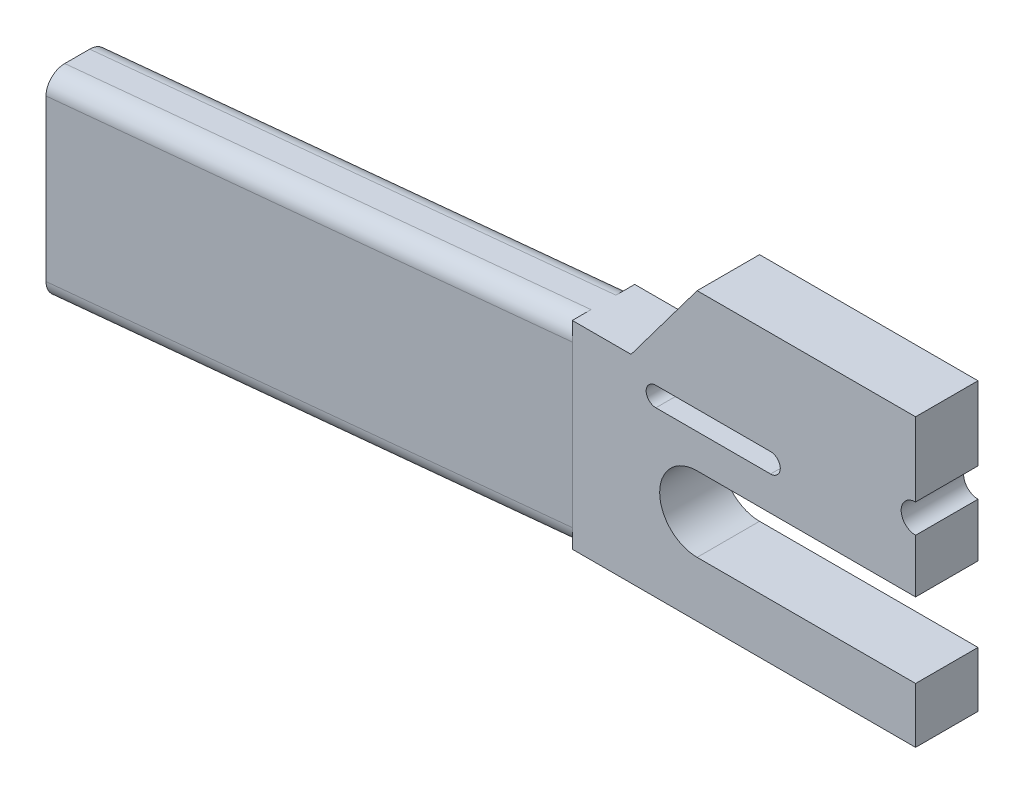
ISO-10303-21;
HEADER;
FILE_DESCRIPTION(('STEP AP214'),'2;1');
FILE_NAME('part.step','',(''),(''),'','','');
FILE_SCHEMA(('AUTOMOTIVE_DESIGN { 1 0 10303 214 1 1 1 1 }'));
ENDSEC;
DATA;
#1=APPLICATION_CONTEXT('core data for automotive mechanical design processes');
#2=APPLICATION_PROTOCOL_DEFINITION('international standard','automotive_design',2000,#1);
#3=PRODUCT_CONTEXT('',#1,'mechanical');
#4=PRODUCT('Part','Part','',(#3));
#5=PRODUCT_RELATED_PRODUCT_CATEGORY('part','',(#4));
#6=PRODUCT_DEFINITION_FORMATION('','',#4);
#7=PRODUCT_DEFINITION_CONTEXT('part definition',#1,'design');
#8=PRODUCT_DEFINITION('design','',#6,#7);
#9=PRODUCT_DEFINITION_SHAPE('','',#8);
#10=(LENGTH_UNIT() NAMED_UNIT(*) SI_UNIT(.MILLI.,.METRE.));
#11=(NAMED_UNIT(*) PLANE_ANGLE_UNIT() SI_UNIT($,.RADIAN.));
#12=(NAMED_UNIT(*) SI_UNIT($,.STERADIAN.) SOLID_ANGLE_UNIT());
#13=UNCERTAINTY_MEASURE_WITH_UNIT(LENGTH_MEASURE(1.E-05),#10,'distance_accuracy_value','');
#14=(GEOMETRIC_REPRESENTATION_CONTEXT(3) GLOBAL_UNCERTAINTY_ASSIGNED_CONTEXT((#13)) GLOBAL_UNIT_ASSIGNED_CONTEXT((#10,
#11,#12)) REPRESENTATION_CONTEXT('',''));
#15=CARTESIAN_POINT('',(0.,0.,0.));
#16=DIRECTION('',(0.,0.,1.));
#17=DIRECTION('',(1.,0.,0.));
#18=AXIS2_PLACEMENT_3D('',#15,#16,#17);
#19=CARTESIAN_POINT('',(-42.9289137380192,18.7333231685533,10.));
#20=DIRECTION('',(1.,0.,0.));
#21=DIRECTION('',(0.,1.,0.));
#22=AXIS2_PLACEMENT_3D('',#19,#20,#21);
#23=PLANE('',#22);
#24=DIRECTION('',(0.,0.,-1.));
#25=VECTOR('',#24,1.);
#26=CARTESIAN_POINT('',(-42.9289137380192,18.7333231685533,10.));
#27=LINE('',#26,#25);
#28=CARTESIAN_POINT('',(-42.9289137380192,18.7333231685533,10.));
#29=VERTEX_POINT('',#28);
#30=CARTESIAN_POINT('',(-42.9289137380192,18.7333231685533,6.99999999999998));
#31=VERTEX_POINT('',#30);
#32=EDGE_CURVE('E666',#29,#31,#27,.T.);
#33=ORIENTED_EDGE('',*,*,#32,.T.);
#34=CARTESIAN_POINT('',(-42.9289137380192,15.7333231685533,10.));
#35=CARTESIAN_POINT('',(-42.9289137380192,15.8177030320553,10.0000080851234));
#36=CARTESIAN_POINT('',(-42.9289137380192,15.9020790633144,9.99644004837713));
#37=CARTESIAN_POINT('',(-42.9289137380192,16.0702274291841,9.98221429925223));
#38=CARTESIAN_POINT('',(-42.9289137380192,16.1539997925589,9.97155692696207));
#39=CARTESIAN_POINT('',(-42.9289137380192,16.3202901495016,9.94322577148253));
#40=CARTESIAN_POINT('',(-42.9289137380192,16.4028090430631,9.92555729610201));
#41=CARTESIAN_POINT('',(-42.9289137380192,16.5660449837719,9.88334725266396));
#42=CARTESIAN_POINT('',(-42.9289137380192,16.6467620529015,9.85880576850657));
#43=CARTESIAN_POINT('',(-42.9289137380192,16.8854317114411,9.77507005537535));
#44=CARTESIAN_POINT('',(-42.9289137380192,17.0399704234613,9.70575297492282));
#45=CARTESIAN_POINT('',(-42.9289137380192,17.3351033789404,9.54220373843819));
#46=CARTESIAN_POINT('',(-42.9289137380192,17.4757000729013,9.44797597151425));
#47=CARTESIAN_POINT('',(-42.9289137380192,17.7391018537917,9.23724864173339));
#48=CARTESIAN_POINT('',(-42.9289137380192,17.8619071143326,9.12074929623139));
#49=CARTESIAN_POINT('',(-42.9289137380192,18.0862344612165,8.86876200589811));
#50=CARTESIAN_POINT('',(-42.9289137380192,18.1877523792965,8.73327035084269));
#51=CARTESIAN_POINT('',(-42.9289137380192,18.3666153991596,8.44715266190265));
#52=CARTESIAN_POINT('',(-42.9289137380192,18.4439557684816,8.29652367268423));
#53=CARTESIAN_POINT('',(-42.9289137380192,18.5722097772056,7.98444905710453));
#54=CARTESIAN_POINT('',(-42.9289137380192,18.623138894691,7.82300982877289));
#55=CARTESIAN_POINT('',(-42.9289137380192,18.6844685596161,7.55048555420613));
#56=CARTESIAN_POINT('',(-42.9289137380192,18.7027779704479,7.44111489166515));
#57=CARTESIAN_POINT('',(-42.9289137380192,18.7272036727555,7.22117810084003));
#58=CARTESIAN_POINT('',(-42.9289137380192,18.7333372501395,7.11061389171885));
#59=CARTESIAN_POINT('',(-42.9289137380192,18.7333231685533,7.00000000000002));
#60=B_SPLINE_CURVE_WITH_KNOTS('',3,(#34,#35,#36,#37,#38,#39,#40,#41,#42,#43,#44,#45,#46,#47,#48,
#49,#50,#51,#52,#53,#54,#55,#56,#57,#58,#59),.UNSPECIFIED.,.F.,.F.,(4,2,2,2,2,2,2,2,2,2,2,2,4),
(0.,0.253057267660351,0.506102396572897,0.758956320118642,1.01180715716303,1.51730545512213,
2.02271474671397,2.528119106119,3.03362233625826,3.5392244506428,4.04452992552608,
4.37657668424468,4.70815170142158),.UNSPECIFIED.);
#61=CARTESIAN_POINT('',(-42.9289137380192,15.7333231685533,10.));
#62=VERTEX_POINT('',#61);
#63=EDGE_CURVE('E542',#62,#31,#60,.T.);
#64=ORIENTED_EDGE('',*,*,#63,.F.);
#65=DIRECTION('',(0.,-1.,0.));
#66=VECTOR('',#65,1.);
#67=CARTESIAN_POINT('',(-42.9289137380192,18.7333231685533,10.));
#68=LINE('',#67,#66);
#69=EDGE_CURVE('E643',#29,#62,#68,.T.);
#70=ORIENTED_EDGE('',*,*,#69,.F.);
#71=EDGE_LOOP('',(#33,#64,#70));
#72=FACE_BOUND('',#71,.T.);
#73=ADVANCED_FACE('F355',(#72),#23,.F.);
#74=CARTESIAN_POINT('',(-42.9289137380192,-10.0131929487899,10.));
#75=VERTEX_POINT('',#74);
#76=CARTESIAN_POINT('',(-42.9289137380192,-13.0131929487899,10.));
#77=VERTEX_POINT('',#76);
#78=EDGE_CURVE('E642',#75,#77,#68,.T.);
#79=ORIENTED_EDGE('',*,*,#78,.F.);
#80=CARTESIAN_POINT('',(-42.9289137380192,-13.0131929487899,6.99999999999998));
#81=CARTESIAN_POINT('',(-42.9289137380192,-13.0132010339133,7.08437986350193));
#82=CARTESIAN_POINT('',(-42.9289137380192,-13.009632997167,7.16875589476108));
#83=CARTESIAN_POINT('',(-42.9289137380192,-12.9954072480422,7.33690426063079));
#84=CARTESIAN_POINT('',(-42.9289137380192,-12.9847498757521,7.42067662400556));
#85=CARTESIAN_POINT('',(-42.9289137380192,-12.9564187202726,7.58696698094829));
#86=CARTESIAN_POINT('',(-42.9289137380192,-12.938750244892,7.66948587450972));
#87=CARTESIAN_POINT('',(-42.9289137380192,-12.8965402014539,7.83272181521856));
#88=CARTESIAN_POINT('',(-42.9289137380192,-12.8719987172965,7.9134388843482));
#89=CARTESIAN_POINT('',(-42.9289137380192,-12.7882630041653,8.1521085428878));
#90=CARTESIAN_POINT('',(-42.9289137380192,-12.7189459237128,8.30664725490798));
#91=CARTESIAN_POINT('',(-42.9289137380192,-12.5553966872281,8.60178021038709));
#92=CARTESIAN_POINT('',(-42.9289137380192,-12.4611689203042,8.74237690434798));
#93=CARTESIAN_POINT('',(-42.9289137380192,-12.2504415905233,9.0057786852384));
#94=CARTESIAN_POINT('',(-42.9289137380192,-12.1339422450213,9.12858394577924));
#95=CARTESIAN_POINT('',(-42.9289137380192,-11.8819549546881,9.35291129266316));
#96=CARTESIAN_POINT('',(-42.9289137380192,-11.7464632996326,9.45442921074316));
#97=CARTESIAN_POINT('',(-42.9289137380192,-11.4603456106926,9.63329223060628));
#98=CARTESIAN_POINT('',(-42.9289137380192,-11.3097166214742,9.71063259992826));
#99=CARTESIAN_POINT('',(-42.9289137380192,-10.9976420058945,9.83888660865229));
#100=CARTESIAN_POINT('',(-42.9289137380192,-10.8362027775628,9.88981572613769));
#101=CARTESIAN_POINT('',(-42.9289137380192,-10.5636785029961,9.95114539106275));
#102=CARTESIAN_POINT('',(-42.9289137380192,-10.4543078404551,9.96945480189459));
#103=CARTESIAN_POINT('',(-42.9289137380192,-10.23437104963,9.99388050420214));
#104=CARTESIAN_POINT('',(-42.9289137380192,-10.1238068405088,10.0000140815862));
#105=CARTESIAN_POINT('',(-42.9289137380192,-10.01319294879,10.));
#106=B_SPLINE_CURVE_WITH_KNOTS('',3,(#80,#81,#82,#83,#84,#85,#86,#87,#88,#89,#90,#91,#92,#93,
#94,#95,#96,#97,#98,#99,#100,#101,#102,#103,#104,#105),.UNSPECIFIED.,.F.,.F.,(4,2,2,2,2,2,2,2,2,
2,2,2,4),(0.,0.253057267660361,0.506102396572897,0.758956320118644,1.01180715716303,
1.51730545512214,2.02271474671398,2.52811910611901,3.03362233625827,3.53922445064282,
4.04452992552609,4.37657668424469,4.7081517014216),.UNSPECIFIED.);
#107=CARTESIAN_POINT('',(-42.9289137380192,-13.0131929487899,6.99999999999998));
#108=VERTEX_POINT('',#107);
#109=EDGE_CURVE('E690',#108,#75,#106,.T.);
#110=ORIENTED_EDGE('',*,*,#109,.F.);
#111=DIRECTION('',(0.,0.,-1.));
#112=VECTOR('',#111,1.);
#113=CARTESIAN_POINT('',(-42.9289137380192,-13.0131929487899,10.));
#114=LINE('',#113,#112);
#115=EDGE_CURVE('E662',#77,#108,#114,.T.);
#116=ORIENTED_EDGE('',*,*,#115,.F.);
#117=EDGE_LOOP('',(#79,#110,#116));
#118=FACE_BOUND('',#117,.T.);
#119=ADVANCED_FACE('F789',(#118),#23,.F.);
#120=CARTESIAN_POINT('',(-42.9289137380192,-13.0131929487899,3.00000000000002));
#121=VERTEX_POINT('',#120);
#122=CARTESIAN_POINT('',(-42.9289137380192,-13.0131929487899,0.));
#123=VERTEX_POINT('',#122);
#124=EDGE_CURVE('E661',#121,#123,#114,.T.);
#125=ORIENTED_EDGE('',*,*,#124,.F.);
#126=CARTESIAN_POINT('',(-42.9289137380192,-10.0131929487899,0.));
#127=CARTESIAN_POINT('',(-42.9289137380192,-10.0975728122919,-8.08512339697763E-06));
#128=CARTESIAN_POINT('',(-42.9289137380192,-10.181948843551,0.00355995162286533));
#129=CARTESIAN_POINT('',(-42.9289137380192,-10.3500972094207,0.0177857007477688));
#130=CARTESIAN_POINT('',(-42.9289137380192,-10.4338695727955,0.0284430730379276));
#131=CARTESIAN_POINT('',(-42.9289137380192,-10.6001599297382,0.0567742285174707));
#132=CARTESIAN_POINT('',(-42.9289137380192,-10.6826788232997,0.0744427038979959));
#133=CARTESIAN_POINT('',(-42.9289137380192,-10.8459147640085,0.11665274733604));
#134=CARTESIAN_POINT('',(-42.9289137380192,-10.9266318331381,0.141194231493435));
#135=CARTESIAN_POINT('',(-42.9289137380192,-11.1653014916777,0.22492994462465));
#136=CARTESIAN_POINT('',(-42.9289137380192,-11.3198402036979,0.294247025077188));
#137=CARTESIAN_POINT('',(-42.9289137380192,-11.614973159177,0.457796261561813));
#138=CARTESIAN_POINT('',(-42.9289137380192,-11.7555698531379,0.552024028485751));
#139=CARTESIAN_POINT('',(-42.9289137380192,-12.0189716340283,0.762751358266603));
#140=CARTESIAN_POINT('',(-42.9289137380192,-12.1417768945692,0.879250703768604));
#141=CARTESIAN_POINT('',(-42.9289137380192,-12.3661042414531,1.13123799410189));
#142=CARTESIAN_POINT('',(-42.9289137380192,-12.4676221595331,1.26672964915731));
#143=CARTESIAN_POINT('',(-42.9289137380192,-12.6464851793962,1.55284733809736));
#144=CARTESIAN_POINT('',(-42.9289137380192,-12.7238255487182,1.70347632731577));
#145=CARTESIAN_POINT('',(-42.9289137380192,-12.8520795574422,2.01555094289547));
#146=CARTESIAN_POINT('',(-42.9289137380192,-12.9030086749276,2.17699017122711));
#147=CARTESIAN_POINT('',(-42.9289137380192,-12.9643383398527,2.44951444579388));
#148=CARTESIAN_POINT('',(-42.9289137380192,-12.9826477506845,2.55888510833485));
#149=CARTESIAN_POINT('',(-42.9289137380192,-13.0070734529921,2.77882189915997));
#150=CARTESIAN_POINT('',(-42.9289137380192,-13.0132070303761,2.88938610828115));
#151=CARTESIAN_POINT('',(-42.9289137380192,-13.0131929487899,2.99999999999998));
#152=B_SPLINE_CURVE_WITH_KNOTS('',3,(#126,#127,#128,#129,#130,#131,#132,#133,#134,#135,#136,
#137,#138,#139,#140,#141,#142,#143,#144,#145,#146,#147,#148,#149,#150,#151),.UNSPECIFIED.,.F.,
.F.,(4,2,2,2,2,2,2,2,2,2,2,2,4),(0.,0.253057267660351,0.506102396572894,0.758956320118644,
1.01180715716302,1.51730545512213,2.02271474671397,2.528119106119,3.03362233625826,
3.53922445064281,4.04452992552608,4.37657668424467,4.70815170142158),.UNSPECIFIED.);
#153=CARTESIAN_POINT('',(-42.9289137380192,-10.0131929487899,0.));
#154=VERTEX_POINT('',#153);
#155=EDGE_CURVE('E563',#154,#121,#152,.T.);
#156=ORIENTED_EDGE('',*,*,#155,.F.);
#157=DIRECTION('',(0.,-1.,0.));
#158=VECTOR('',#157,1.);
#159=CARTESIAN_POINT('',(-42.9289137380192,18.7333231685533,0.));
#160=LINE('',#159,#158);
#161=EDGE_CURVE('E615',#154,#123,#160,.T.);
#162=ORIENTED_EDGE('',*,*,#161,.T.);
#163=EDGE_LOOP('',(#125,#156,#162));
#164=FACE_BOUND('',#163,.T.);
#165=ADVANCED_FACE('F777',(#164),#23,.F.);
#166=CARTESIAN_POINT('',(-22.9289137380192,1.86134185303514,10.));
#167=DIRECTION('',(0.,0.,1.));
#168=DIRECTION('',(1.,0.,0.));
#169=AXIS2_PLACEMENT_3D('',#166,#167,#168);
#170=PLANE('',#169);
#171=CARTESIAN_POINT('',(-22.9289137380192,1.86134185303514,10.));
#172=DIRECTION('',(0.,0.,-1.));
#173=DIRECTION('',(1.,0.,0.));
#174=AXIS2_PLACEMENT_3D('',#171,#172,#173);
#175=CIRCLE('',#174,6.);
#176=CARTESIAN_POINT('',(-22.9289137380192,-4.13865814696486,10.));
#177=VERTEX_POINT('',#176);
#178=CARTESIAN_POINT('',(-22.9289137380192,7.86134185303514,10.));
#179=VERTEX_POINT('',#178);
#180=EDGE_CURVE('E625',#177,#179,#175,.T.);
#181=ORIENTED_EDGE('',*,*,#180,.T.);
#182=DIRECTION('',(1.,0.,0.));
#183=VECTOR('',#182,1.);
#184=CARTESIAN_POINT('',(-22.9289137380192,7.86134185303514,10.));
#185=LINE('',#184,#183);
#186=CARTESIAN_POINT('',(12.0710862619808,7.86134185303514,10.));
#187=VERTEX_POINT('',#186);
#188=EDGE_CURVE('E628',#179,#187,#185,.T.);
#189=ORIENTED_EDGE('',*,*,#188,.T.);
#190=DIRECTION('',(0.,1.,0.));
#191=VECTOR('',#190,1.);
#192=CARTESIAN_POINT('',(12.0710862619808,7.86134185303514,10.));
#193=LINE('',#192,#191);
#194=CARTESIAN_POINT('',(12.0710862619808,16.4235089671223,10.));
#195=VERTEX_POINT('',#194);
#196=EDGE_CURVE('E630',#187,#195,#193,.T.);
#197=ORIENTED_EDGE('',*,*,#196,.T.);
#198=CARTESIAN_POINT('',(12.0710862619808,18.7333231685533,10.));
#199=DIRECTION('',(0.,0.,-1.));
#200=DIRECTION('',(1.,0.,0.));
#201=AXIS2_PLACEMENT_3D('',#198,#199,#200);
#202=CIRCLE('',#201,2.30981420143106);
#203=CARTESIAN_POINT('',(12.0710862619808,21.0431373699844,10.));
#204=VERTEX_POINT('',#203);
#205=EDGE_CURVE('E632',#195,#204,#202,.T.);
#206=ORIENTED_EDGE('',*,*,#205,.T.);
#207=DIRECTION('',(0.,1.,0.));
#208=VECTOR('',#207,1.);
#209=CARTESIAN_POINT('',(12.0710862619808,21.0431373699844,10.));
#210=LINE('',#209,#208);
#211=CARTESIAN_POINT('',(12.0710862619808,32.8613418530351,10.));
#212=VERTEX_POINT('',#211);
#213=EDGE_CURVE('E634',#204,#212,#210,.T.);
#214=ORIENTED_EDGE('',*,*,#213,.T.);
#215=DIRECTION('',(-1.,0.,0.));
#216=VECTOR('',#215,1.);
#217=CARTESIAN_POINT('',(12.0710862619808,32.8613418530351,10.));
#218=LINE('',#217,#216);
#219=CARTESIAN_POINT('',(-22.9289137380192,32.8613418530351,10.));
#220=VERTEX_POINT('',#219);
#221=EDGE_CURVE('E636',#212,#220,#218,.T.);
#222=ORIENTED_EDGE('',*,*,#221,.T.);
#223=DIRECTION('',(-0.599451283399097,-0.800411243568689,0.));
#224=VECTOR('',#223,1.);
#225=CARTESIAN_POINT('',(-22.9289137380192,32.8613418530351,10.));
#226=LINE('',#225,#224);
#227=CARTESIAN_POINT('',(-33.5097982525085,18.7333231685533,10.));
#228=VERTEX_POINT('',#227);
#229=EDGE_CURVE('E638',#220,#228,#226,.T.);
#230=ORIENTED_EDGE('',*,*,#229,.T.);
#231=DIRECTION('',(-1.,0.,0.));
#232=VECTOR('',#231,1.);
#233=CARTESIAN_POINT('',(-33.5097982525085,18.7333231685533,10.));
#234=LINE('',#233,#232);
#235=EDGE_CURVE('E640',#228,#29,#234,.T.);
#236=ORIENTED_EDGE('',*,*,#235,.T.);
#237=ORIENTED_EDGE('',*,*,#69,.T.);
#238=DIRECTION('',(0.,1.,0.));
#239=VECTOR('',#238,1.);
#240=CARTESIAN_POINT('',(-42.9289137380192,15.7333231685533,10.));
#241=LINE('',#240,#239);
#242=EDGE_CURVE('E538',#75,#62,#241,.T.);
#243=ORIENTED_EDGE('',*,*,#242,.F.);
#244=ORIENTED_EDGE('',*,*,#78,.T.);
#245=DIRECTION('',(1.,0.,0.));
#246=VECTOR('',#245,1.);
#247=CARTESIAN_POINT('',(12.0710862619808,-13.0131929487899,10.));
#248=LINE('',#247,#246);
#249=CARTESIAN_POINT('',(12.0710862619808,-13.0131929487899,10.));
#250=VERTEX_POINT('',#249);
#251=EDGE_CURVE('E646',#77,#250,#248,.T.);
#252=ORIENTED_EDGE('',*,*,#251,.T.);
#253=DIRECTION('',(0.,1.,0.));
#254=VECTOR('',#253,1.);
#255=CARTESIAN_POINT('',(12.0710862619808,-4.13865814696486,10.));
#256=LINE('',#255,#254);
#257=CARTESIAN_POINT('',(12.0710862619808,-4.13865814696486,10.));
#258=VERTEX_POINT('',#257);
#259=EDGE_CURVE('E648',#250,#258,#256,.T.);
#260=ORIENTED_EDGE('',*,*,#259,.T.);
#261=DIRECTION('',(-1.,0.,0.));
#262=VECTOR('',#261,1.);
#263=CARTESIAN_POINT('',(-22.9289137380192,-4.13865814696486,10.));
#264=LINE('',#263,#262);
#265=EDGE_CURVE('E650',#258,#177,#264,.T.);
#266=ORIENTED_EDGE('',*,*,#265,.T.);
#267=EDGE_LOOP('',(#181,#189,#197,#206,#214,#222,#230,#236,#237,#243,#244,#252,#260,#266));
#268=FACE_BOUND('',#267,.T.);
#269=DIRECTION('',(1.,0.,0.));
#270=VECTOR('',#269,1.);
#271=CARTESIAN_POINT('',(-29.5347691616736,13.3079456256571,10.));
#272=LINE('',#271,#270);
#273=CARTESIAN_POINT('',(-29.5347691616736,13.3079456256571,10.));
#274=VERTEX_POINT('',#273);
#275=CARTESIAN_POINT('',(-11.1636887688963,13.3079456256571,10.));
#276=VERTEX_POINT('',#275);
#277=EDGE_CURVE('E581',#274,#276,#272,.T.);
#278=ORIENTED_EDGE('',*,*,#277,.F.);
#279=CARTESIAN_POINT('',(-29.5347691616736,14.8657272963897,10.));
#280=DIRECTION('',(0.,0.,1.));
#281=DIRECTION('',(1.,0.,0.));
#282=AXIS2_PLACEMENT_3D('',#279,#280,#281);
#283=CIRCLE('',#282,1.55778167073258);
#284=CARTESIAN_POINT('',(-29.5347691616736,16.4235089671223,10.));
#285=VERTEX_POINT('',#284);
#286=EDGE_CURVE('E579',#285,#274,#283,.T.);
#287=ORIENTED_EDGE('',*,*,#286,.F.);
#288=DIRECTION('',(-1.,0.,0.));
#289=VECTOR('',#288,1.);
#290=CARTESIAN_POINT('',(-29.5347691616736,16.4235089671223,10.));
#291=LINE('',#290,#289);
#292=CARTESIAN_POINT('',(-11.1636887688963,16.4235089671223,10.));
#293=VERTEX_POINT('',#292);
#294=EDGE_CURVE('E586',#293,#285,#291,.T.);
#295=ORIENTED_EDGE('',*,*,#294,.F.);
#296=CARTESIAN_POINT('',(-11.1636887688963,14.8657272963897,10.));
#297=DIRECTION('',(0.,0.,1.));
#298=DIRECTION('',(-1.,0.,0.));
#299=AXIS2_PLACEMENT_3D('',#296,#297,#298);
#300=CIRCLE('',#299,1.55778167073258);
#301=EDGE_CURVE('E583',#276,#293,#300,.T.);
#302=ORIENTED_EDGE('',*,*,#301,.F.);
#303=EDGE_LOOP('',(#278,#287,#295,#302));
#304=FACE_BOUND('',#303,.T.);
#305=ADVANCED_FACE('F753',(#268,#304),#170,.T.);
#306=CARTESIAN_POINT('',(-22.9289137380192,1.86134185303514,0.));
#307=DIRECTION('',(0.,0.,1.));
#308=DIRECTION('',(1.,0.,0.));
#309=AXIS2_PLACEMENT_3D('',#306,#307,#308);
#310=PLANE('',#309);
#311=CARTESIAN_POINT('',(-22.9289137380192,1.86134185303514,0.));
#312=DIRECTION('',(0.,0.,-1.));
#313=DIRECTION('',(1.,0.,0.));
#314=AXIS2_PLACEMENT_3D('',#311,#312,#313);
#315=CIRCLE('',#314,6.);
#316=CARTESIAN_POINT('',(-22.9289137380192,-4.13865814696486,0.));
#317=VERTEX_POINT('',#316);
#318=CARTESIAN_POINT('',(-22.9289137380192,7.86134185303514,0.));
#319=VERTEX_POINT('',#318);
#320=EDGE_CURVE('E598',#317,#319,#315,.T.);
#321=ORIENTED_EDGE('',*,*,#320,.F.);
#322=DIRECTION('',(-1.,0.,0.));
#323=VECTOR('',#322,1.);
#324=CARTESIAN_POINT('',(-22.9289137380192,-4.13865814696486,0.));
#325=LINE('',#324,#323);
#326=CARTESIAN_POINT('',(12.0710862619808,-4.13865814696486,0.));
#327=VERTEX_POINT('',#326);
#328=EDGE_CURVE('E623',#327,#317,#325,.T.);
#329=ORIENTED_EDGE('',*,*,#328,.F.);
#330=DIRECTION('',(0.,1.,0.));
#331=VECTOR('',#330,1.);
#332=CARTESIAN_POINT('',(12.0710862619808,-4.13865814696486,0.));
#333=LINE('',#332,#331);
#334=CARTESIAN_POINT('',(12.0710862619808,-13.0131929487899,0.));
#335=VERTEX_POINT('',#334);
#336=EDGE_CURVE('E621',#335,#327,#333,.T.);
#337=ORIENTED_EDGE('',*,*,#336,.F.);
#338=DIRECTION('',(1.,0.,0.));
#339=VECTOR('',#338,1.);
#340=CARTESIAN_POINT('',(12.0710862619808,-13.0131929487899,0.));
#341=LINE('',#340,#339);
#342=EDGE_CURVE('E619',#123,#335,#341,.T.);
#343=ORIENTED_EDGE('',*,*,#342,.F.);
#344=ORIENTED_EDGE('',*,*,#161,.F.);
#345=DIRECTION('',(0.,-1.,0.));
#346=VECTOR('',#345,1.);
#347=CARTESIAN_POINT('',(-42.9289137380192,15.7333231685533,0.));
#348=LINE('',#347,#346);
#349=CARTESIAN_POINT('',(-42.9289137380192,15.7333231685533,0.));
#350=VERTEX_POINT('',#349);
#351=EDGE_CURVE('E561',#350,#154,#348,.T.);
#352=ORIENTED_EDGE('',*,*,#351,.F.);
#353=CARTESIAN_POINT('',(-42.9289137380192,18.7333231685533,0.));
#354=VERTEX_POINT('',#353);
#355=EDGE_CURVE('E618',#354,#350,#160,.T.);
#356=ORIENTED_EDGE('',*,*,#355,.F.);
#357=DIRECTION('',(-1.,0.,0.));
#358=VECTOR('',#357,1.);
#359=CARTESIAN_POINT('',(-33.5097982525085,18.7333231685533,0.));
#360=LINE('',#359,#358);
#361=CARTESIAN_POINT('',(-33.5097982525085,18.7333231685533,0.));
#362=VERTEX_POINT('',#361);
#363=EDGE_CURVE('E613',#362,#354,#360,.T.);
#364=ORIENTED_EDGE('',*,*,#363,.F.);
#365=DIRECTION('',(-0.599451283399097,-0.800411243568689,0.));
#366=VECTOR('',#365,1.);
#367=CARTESIAN_POINT('',(-22.9289137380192,32.8613418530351,0.));
#368=LINE('',#367,#366);
#369=CARTESIAN_POINT('',(-22.9289137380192,32.8613418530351,0.));
#370=VERTEX_POINT('',#369);
#371=EDGE_CURVE('E611',#370,#362,#368,.T.);
#372=ORIENTED_EDGE('',*,*,#371,.F.);
#373=DIRECTION('',(-1.,0.,0.));
#374=VECTOR('',#373,1.);
#375=CARTESIAN_POINT('',(12.0710862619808,32.8613418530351,0.));
#376=LINE('',#375,#374);
#377=CARTESIAN_POINT('',(12.0710862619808,32.8613418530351,0.));
#378=VERTEX_POINT('',#377);
#379=EDGE_CURVE('E609',#378,#370,#376,.T.);
#380=ORIENTED_EDGE('',*,*,#379,.F.);
#381=DIRECTION('',(0.,1.,0.));
#382=VECTOR('',#381,1.);
#383=CARTESIAN_POINT('',(12.0710862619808,21.0431373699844,0.));
#384=LINE('',#383,#382);
#385=CARTESIAN_POINT('',(12.0710862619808,21.0431373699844,0.));
#386=VERTEX_POINT('',#385);
#387=EDGE_CURVE('E607',#386,#378,#384,.T.);
#388=ORIENTED_EDGE('',*,*,#387,.F.);
#389=CARTESIAN_POINT('',(12.0710862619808,18.7333231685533,0.));
#390=DIRECTION('',(0.,0.,-1.));
#391=DIRECTION('',(1.,0.,0.));
#392=AXIS2_PLACEMENT_3D('',#389,#390,#391);
#393=CIRCLE('',#392,2.30981420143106);
#394=CARTESIAN_POINT('',(12.0710862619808,16.4235089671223,0.));
#395=VERTEX_POINT('',#394);
#396=EDGE_CURVE('E605',#395,#386,#393,.T.);
#397=ORIENTED_EDGE('',*,*,#396,.F.);
#398=DIRECTION('',(0.,1.,0.));
#399=VECTOR('',#398,1.);
#400=CARTESIAN_POINT('',(12.0710862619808,7.86134185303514,0.));
#401=LINE('',#400,#399);
#402=CARTESIAN_POINT('',(12.0710862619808,7.86134185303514,0.));
#403=VERTEX_POINT('',#402);
#404=EDGE_CURVE('E603',#403,#395,#401,.T.);
#405=ORIENTED_EDGE('',*,*,#404,.F.);
#406=DIRECTION('',(1.,0.,0.));
#407=VECTOR('',#406,1.);
#408=CARTESIAN_POINT('',(-22.9289137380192,7.86134185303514,0.));
#409=LINE('',#408,#407);
#410=EDGE_CURVE('E601',#319,#403,#409,.T.);
#411=ORIENTED_EDGE('',*,*,#410,.F.);
#412=EDGE_LOOP('',(#321,#329,#337,#343,#344,#352,#356,#364,#372,#380,#388,#397,#405,#411));
#413=FACE_BOUND('',#412,.T.);
#414=CARTESIAN_POINT('',(-29.5347691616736,14.8657272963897,0.));
#415=DIRECTION('',(0.,0.,1.));
#416=DIRECTION('',(1.,0.,0.));
#417=AXIS2_PLACEMENT_3D('',#414,#415,#416);
#418=CIRCLE('',#417,1.55778167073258);
#419=CARTESIAN_POINT('',(-29.5347691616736,16.4235089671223,0.));
#420=VERTEX_POINT('',#419);
#421=CARTESIAN_POINT('',(-29.5347691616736,13.3079456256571,0.));
#422=VERTEX_POINT('',#421);
#423=EDGE_CURVE('E544',#420,#422,#418,.T.);
#424=ORIENTED_EDGE('',*,*,#423,.T.);
#425=DIRECTION('',(1.,0.,0.));
#426=VECTOR('',#425,1.);
#427=CARTESIAN_POINT('',(-29.5347691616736,13.3079456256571,0.));
#428=LINE('',#427,#426);
#429=CARTESIAN_POINT('',(-11.1636887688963,13.3079456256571,0.));
#430=VERTEX_POINT('',#429);
#431=EDGE_CURVE('E547',#422,#430,#428,.T.);
#432=ORIENTED_EDGE('',*,*,#431,.T.);
#433=CARTESIAN_POINT('',(-11.1636887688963,14.8657272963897,0.));
#434=DIRECTION('',(0.,0.,1.));
#435=DIRECTION('',(-1.,0.,0.));
#436=AXIS2_PLACEMENT_3D('',#433,#434,#435);
#437=CIRCLE('',#436,1.55778167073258);
#438=CARTESIAN_POINT('',(-11.1636887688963,16.4235089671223,0.));
#439=VERTEX_POINT('',#438);
#440=EDGE_CURVE('E573',#430,#439,#437,.T.);
#441=ORIENTED_EDGE('',*,*,#440,.T.);
#442=DIRECTION('',(-1.,0.,0.));
#443=VECTOR('',#442,1.);
#444=CARTESIAN_POINT('',(-29.5347691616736,16.4235089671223,0.));
#445=LINE('',#444,#443);
#446=EDGE_CURVE('E576',#439,#420,#445,.T.);
#447=ORIENTED_EDGE('',*,*,#446,.T.);
#448=EDGE_LOOP('',(#424,#432,#441,#447));
#449=FACE_BOUND('',#448,.T.);
#450=ADVANCED_FACE('F764',(#413,#449),#310,.F.);
#451=CARTESIAN_POINT('',(-22.9289137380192,1.86134185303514,10.));
#452=DIRECTION('',(0.,0.,-1.));
#453=DIRECTION('',(-1.,0.,0.));
#454=AXIS2_PLACEMENT_3D('',#451,#452,#453);
#455=CYLINDRICAL_SURFACE('',#454,6.);
#456=ORIENTED_EDGE('',*,*,#320,.T.);
#457=DIRECTION('',(0.,0.,-1.));
#458=VECTOR('',#457,1.);
#459=CARTESIAN_POINT('',(-22.9289137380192,7.86134185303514,10.));
#460=LINE('',#459,#458);
#461=EDGE_CURVE('E11',#179,#319,#460,.T.);
#462=ORIENTED_EDGE('',*,*,#461,.F.);
#463=ORIENTED_EDGE('',*,*,#180,.F.);
#464=DIRECTION('',(0.,0.,-1.));
#465=VECTOR('',#464,1.);
#466=CARTESIAN_POINT('',(-22.9289137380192,-4.13865814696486,10.));
#467=LINE('',#466,#465);
#468=EDGE_CURVE('E652',#177,#317,#467,.T.);
#469=ORIENTED_EDGE('',*,*,#468,.T.);
#470=EDGE_LOOP('',(#456,#462,#463,#469));
#471=FACE_BOUND('',#470,.T.);
#472=ADVANCED_FACE('F357',(#471),#455,.F.);
#473=CARTESIAN_POINT('',(-22.9289137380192,7.86134185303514,10.));
#474=DIRECTION('',(0.,1.,0.));
#475=DIRECTION('',(0.,0.,1.));
#476=AXIS2_PLACEMENT_3D('',#473,#474,#475);
#477=PLANE('',#476);
#478=ORIENTED_EDGE('',*,*,#410,.T.);
#479=DIRECTION('',(0.,0.,-1.));
#480=VECTOR('',#479,1.);
#481=CARTESIAN_POINT('',(12.0710862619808,7.86134185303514,10.));
#482=LINE('',#481,#480);
#483=EDGE_CURVE('E370',#187,#403,#482,.T.);
#484=ORIENTED_EDGE('',*,*,#483,.F.);
#485=ORIENTED_EDGE('',*,*,#188,.F.);
#486=ORIENTED_EDGE('',*,*,#461,.T.);
#487=EDGE_LOOP('',(#478,#484,#485,#486));
#488=FACE_BOUND('',#487,.T.);
#489=ADVANCED_FACE('F824',(#488),#477,.F.);
#490=CARTESIAN_POINT('',(12.0710862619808,7.86134185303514,10.));
#491=DIRECTION('',(-1.,0.,0.));
#492=DIRECTION('',(0.,0.,1.));
#493=AXIS2_PLACEMENT_3D('',#490,#491,#492);
#494=PLANE('',#493);
#495=ORIENTED_EDGE('',*,*,#404,.T.);
#496=DIRECTION('',(0.,0.,-1.));
#497=VECTOR('',#496,1.);
#498=CARTESIAN_POINT('',(12.0710862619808,16.4235089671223,10.));
#499=LINE('',#498,#497);
#500=EDGE_CURVE('E680',#195,#395,#499,.T.);
#501=ORIENTED_EDGE('',*,*,#500,.F.);
#502=ORIENTED_EDGE('',*,*,#196,.F.);
#503=ORIENTED_EDGE('',*,*,#483,.T.);
#504=EDGE_LOOP('',(#495,#501,#502,#503));
#505=FACE_BOUND('',#504,.T.);
#506=ADVANCED_FACE('F821',(#505),#494,.F.);
#507=CARTESIAN_POINT('',(12.0710862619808,18.7333231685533,10.));
#508=DIRECTION('',(0.,0.,-1.));
#509=DIRECTION('',(-1.,0.,0.));
#510=AXIS2_PLACEMENT_3D('',#507,#508,#509);
#511=CYLINDRICAL_SURFACE('',#510,2.30981420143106);
#512=ORIENTED_EDGE('',*,*,#396,.T.);
#513=DIRECTION('',(0.,0.,-1.));
#514=VECTOR('',#513,1.);
#515=CARTESIAN_POINT('',(12.0710862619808,21.0431373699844,10.));
#516=LINE('',#515,#514);
#517=EDGE_CURVE('E677',#204,#386,#516,.T.);
#518=ORIENTED_EDGE('',*,*,#517,.F.);
#519=ORIENTED_EDGE('',*,*,#205,.F.);
#520=ORIENTED_EDGE('',*,*,#500,.T.);
#521=EDGE_LOOP('',(#512,#518,#519,#520));
#522=FACE_BOUND('',#521,.T.);
#523=ADVANCED_FACE('F817',(#522),#511,.F.);
#524=CARTESIAN_POINT('',(12.0710862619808,21.0431373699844,10.));
#525=DIRECTION('',(-1.,0.,0.));
#526=DIRECTION('',(0.,0.,1.));
#527=AXIS2_PLACEMENT_3D('',#524,#525,#526);
#528=PLANE('',#527);
#529=ORIENTED_EDGE('',*,*,#387,.T.);
#530=DIRECTION('',(0.,0.,-1.));
#531=VECTOR('',#530,1.);
#532=CARTESIAN_POINT('',(12.0710862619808,32.8613418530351,10.));
#533=LINE('',#532,#531);
#534=EDGE_CURVE('E674',#212,#378,#533,.T.);
#535=ORIENTED_EDGE('',*,*,#534,.F.);
#536=ORIENTED_EDGE('',*,*,#213,.F.);
#537=ORIENTED_EDGE('',*,*,#517,.T.);
#538=EDGE_LOOP('',(#529,#535,#536,#537));
#539=FACE_BOUND('',#538,.T.);
#540=ADVANCED_FACE('F813',(#539),#528,.F.);
#541=CARTESIAN_POINT('',(12.0710862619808,32.8613418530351,10.));
#542=DIRECTION('',(0.,-1.,0.));
#543=DIRECTION('',(1.,0.,0.));
#544=AXIS2_PLACEMENT_3D('',#541,#542,#543);
#545=PLANE('',#544);
#546=ORIENTED_EDGE('',*,*,#379,.T.);
#547=DIRECTION('',(0.,0.,-1.));
#548=VECTOR('',#547,1.);
#549=CARTESIAN_POINT('',(-22.9289137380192,32.8613418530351,10.));
#550=LINE('',#549,#548);
#551=EDGE_CURVE('E671',#220,#370,#550,.T.);
#552=ORIENTED_EDGE('',*,*,#551,.F.);
#553=ORIENTED_EDGE('',*,*,#221,.F.);
#554=ORIENTED_EDGE('',*,*,#534,.T.);
#555=EDGE_LOOP('',(#546,#552,#553,#554));
#556=FACE_BOUND('',#555,.T.);
#557=ADVANCED_FACE('F808',(#556),#545,.F.);
#558=CARTESIAN_POINT('',(-22.9289137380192,32.8613418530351,10.));
#559=DIRECTION('',(0.800411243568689,-0.599451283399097,0.));
#560=DIRECTION('',(0.599451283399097,0.800411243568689,0.));
#561=AXIS2_PLACEMENT_3D('',#558,#559,#560);
#562=PLANE('',#561);
#563=ORIENTED_EDGE('',*,*,#371,.T.);
#564=DIRECTION('',(0.,0.,-1.));
#565=VECTOR('',#564,1.);
#566=CARTESIAN_POINT('',(-33.5097982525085,18.7333231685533,10.));
#567=LINE('',#566,#565);
#568=EDGE_CURVE('E668',#228,#362,#567,.T.);
#569=ORIENTED_EDGE('',*,*,#568,.F.);
#570=ORIENTED_EDGE('',*,*,#229,.F.);
#571=ORIENTED_EDGE('',*,*,#551,.T.);
#572=EDGE_LOOP('',(#563,#569,#570,#571));
#573=FACE_BOUND('',#572,.T.);
#574=ADVANCED_FACE('F803',(#573),#562,.F.);
#575=CARTESIAN_POINT('',(-33.5097982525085,18.7333231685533,10.));
#576=DIRECTION('',(0.,-1.,0.));
#577=DIRECTION('',(1.,0.,0.));
#578=AXIS2_PLACEMENT_3D('',#575,#576,#577);
#579=PLANE('',#578);
#580=ORIENTED_EDGE('',*,*,#363,.T.);
#581=CARTESIAN_POINT('',(-42.9289137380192,18.7333231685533,3.00000000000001));
#582=VERTEX_POINT('',#581);
#583=EDGE_CURVE('E665',#582,#354,#27,.T.);
#584=ORIENTED_EDGE('',*,*,#583,.F.);
#585=DIRECTION('',(0.994521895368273,0.,-0.104528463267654));
#586=VECTOR('',#585,1.);
#587=CARTESIAN_POINT('',(-119.227960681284,18.7333231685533,11.0193529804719));
#588=LINE('',#587,#586);
#589=CARTESIAN_POINT('',(-119.227960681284,18.7333231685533,11.0193529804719));
#590=VERTEX_POINT('',#589);
#591=EDGE_CURVE('E378',#590,#582,#588,.T.);
#592=ORIENTED_EDGE('',*,*,#591,.F.);
#593=DIRECTION('',(0.,0.,-1.));
#594=VECTOR('',#593,1.);
#595=CARTESIAN_POINT('',(-119.227960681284,18.7333231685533,15.0193529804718));
#596=LINE('',#595,#594);
#597=CARTESIAN_POINT('',(-119.227960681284,18.7333231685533,15.0193529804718));
#598=VERTEX_POINT('',#597);
#599=EDGE_CURVE('E518',#598,#590,#596,.T.);
#600=ORIENTED_EDGE('',*,*,#599,.F.);
#601=DIRECTION('',(0.994521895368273,0.,-0.104528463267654));
#602=VECTOR('',#601,1.);
#603=CARTESIAN_POINT('',(-119.227960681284,18.7333231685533,15.0193529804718));
#604=LINE('',#603,#602);
#605=EDGE_CURVE('E524',#598,#31,#604,.T.);
#606=ORIENTED_EDGE('',*,*,#605,.T.);
#607=ORIENTED_EDGE('',*,*,#32,.F.);
#608=ORIENTED_EDGE('',*,*,#235,.F.);
#609=ORIENTED_EDGE('',*,*,#568,.T.);
#610=EDGE_LOOP('',(#580,#584,#592,#600,#606,#607,#608,#609));
#611=FACE_BOUND('',#610,.T.);
#612=ADVANCED_FACE('F521',(#611),#579,.F.);
#613=ORIENTED_EDGE('',*,*,#355,.T.);
#614=CARTESIAN_POINT('',(-42.9289137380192,18.7333231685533,3.));
#615=CARTESIAN_POINT('',(-42.9289137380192,18.7333312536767,2.91562013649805));
#616=CARTESIAN_POINT('',(-42.9289137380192,18.7297632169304,2.8312441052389));
#617=CARTESIAN_POINT('',(-42.9289137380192,18.7155374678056,2.66309573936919));
#618=CARTESIAN_POINT('',(-42.9289137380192,18.7048800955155,2.57932337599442));
#619=CARTESIAN_POINT('',(-42.9289137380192,18.676548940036,2.41303301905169));
#620=CARTESIAN_POINT('',(-42.9289137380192,18.6588804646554,2.33051412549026));
#621=CARTESIAN_POINT('',(-42.9289137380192,18.6166704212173,2.16727818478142));
#622=CARTESIAN_POINT('',(-42.9289137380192,18.5921289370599,2.08656111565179));
#623=CARTESIAN_POINT('',(-42.9289137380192,18.5083932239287,1.84789145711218));
#624=CARTESIAN_POINT('',(-42.9289137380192,18.4390761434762,1.693352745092));
#625=CARTESIAN_POINT('',(-42.9289137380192,18.2755269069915,1.39821978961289));
#626=CARTESIAN_POINT('',(-42.9289137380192,18.1812991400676,1.257623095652));
#627=CARTESIAN_POINT('',(-42.9289137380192,17.9705718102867,0.994221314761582));
#628=CARTESIAN_POINT('',(-42.9289137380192,17.8540724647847,0.871416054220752));
#629=CARTESIAN_POINT('',(-42.9289137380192,17.6020851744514,0.647088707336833));
#630=CARTESIAN_POINT('',(-42.9289137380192,17.466593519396,0.545570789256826));
#631=CARTESIAN_POINT('',(-42.9289137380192,17.180475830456,0.366707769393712));
#632=CARTESIAN_POINT('',(-42.9289137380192,17.0298468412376,0.289367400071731));
#633=CARTESIAN_POINT('',(-42.9289137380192,16.7177722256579,0.161113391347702));
#634=CARTESIAN_POINT('',(-42.9289137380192,16.5563329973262,0.110184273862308));
#635=CARTESIAN_POINT('',(-42.9289137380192,16.2838087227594,0.0488546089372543));
#636=CARTESIAN_POINT('',(-42.9289137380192,16.1744380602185,0.0305451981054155));
#637=CARTESIAN_POINT('',(-42.9289137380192,15.9545012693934,0.00611949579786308));
#638=CARTESIAN_POINT('',(-42.9289137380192,15.8439370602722,-1.40815861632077E-05));
#639=CARTESIAN_POINT('',(-42.9289137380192,15.7333231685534,0.));
#640=B_SPLINE_CURVE_WITH_KNOTS('',3,(#614,#615,#616,#617,#618,#619,#620,#621,#622,#623,#624,
#625,#626,#627,#628,#629,#630,#631,#632,#633,#634,#635,#636,#637,#638,#639),.UNSPECIFIED.,.F.,
.F.,(4,2,2,2,2,2,2,2,2,2,2,2,4),(0.,0.25305726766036,0.506102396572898,0.758956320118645,
1.01180715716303,1.51730545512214,2.02271474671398,2.528119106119,3.03362233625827,
3.53922445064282,4.04452992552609,4.37657668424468,4.70815170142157),.UNSPECIFIED.);
#641=EDGE_CURVE('E359',#582,#350,#640,.T.);
#642=ORIENTED_EDGE('',*,*,#641,.F.);
#643=ORIENTED_EDGE('',*,*,#583,.T.);
#644=EDGE_LOOP('',(#613,#642,#643));
#645=FACE_BOUND('',#644,.T.);
#646=ADVANCED_FACE('F695',(#645),#23,.F.);
#647=CARTESIAN_POINT('',(12.0710862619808,-13.0131929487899,10.));
#648=DIRECTION('',(0.,1.,0.));
#649=DIRECTION('',(-1.,0.,0.));
#650=AXIS2_PLACEMENT_3D('',#647,#648,#649);
#651=PLANE('',#650);
#652=ORIENTED_EDGE('',*,*,#342,.T.);
#653=DIRECTION('',(0.,0.,-1.));
#654=VECTOR('',#653,1.);
#655=CARTESIAN_POINT('',(12.0710862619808,-13.0131929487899,10.));
#656=LINE('',#655,#654);
#657=EDGE_CURVE('E658',#250,#335,#656,.T.);
#658=ORIENTED_EDGE('',*,*,#657,.F.);
#659=ORIENTED_EDGE('',*,*,#251,.F.);
#660=ORIENTED_EDGE('',*,*,#115,.T.);
#661=DIRECTION('',(0.994521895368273,0.,-0.104528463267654));
#662=VECTOR('',#661,1.);
#663=CARTESIAN_POINT('',(-119.227960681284,-13.0131929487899,15.0193529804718));
#664=LINE('',#663,#662);
#665=CARTESIAN_POINT('',(-119.227960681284,-13.0131929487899,15.0193529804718));
#666=VERTEX_POINT('',#665);
#667=EDGE_CURVE('E555',#666,#108,#664,.T.);
#668=ORIENTED_EDGE('',*,*,#667,.F.);
#669=DIRECTION('',(0.,0.,1.));
#670=VECTOR('',#669,1.);
#671=CARTESIAN_POINT('',(-119.227960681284,-13.0131929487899,15.0193529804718));
#672=LINE('',#671,#670);
#673=CARTESIAN_POINT('',(-119.227960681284,-13.0131929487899,11.0193529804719));
#674=VERTEX_POINT('',#673);
#675=EDGE_CURVE('E716',#674,#666,#672,.T.);
#676=ORIENTED_EDGE('',*,*,#675,.F.);
#677=DIRECTION('',(0.994521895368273,0.,-0.104528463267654));
#678=VECTOR('',#677,1.);
#679=CARTESIAN_POINT('',(-119.227960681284,-13.0131929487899,11.0193529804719));
#680=LINE('',#679,#678);
#681=EDGE_CURVE('E557',#674,#121,#680,.T.);
#682=ORIENTED_EDGE('',*,*,#681,.T.);
#683=ORIENTED_EDGE('',*,*,#124,.T.);
#684=EDGE_LOOP('',(#652,#658,#659,#660,#668,#676,#682,#683));
#685=FACE_BOUND('',#684,.T.);
#686=ADVANCED_FACE('F745',(#685),#651,.F.);
#687=CARTESIAN_POINT('',(12.0710862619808,-4.13865814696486,10.));
#688=DIRECTION('',(-1.,0.,0.));
#689=DIRECTION('',(0.,0.,1.));
#690=AXIS2_PLACEMENT_3D('',#687,#688,#689);
#691=PLANE('',#690);
#692=ORIENTED_EDGE('',*,*,#336,.T.);
#693=DIRECTION('',(0.,0.,-1.));
#694=VECTOR('',#693,1.);
#695=CARTESIAN_POINT('',(12.0710862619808,-4.13865814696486,10.));
#696=LINE('',#695,#694);
#697=EDGE_CURVE('E655',#258,#327,#696,.T.);
#698=ORIENTED_EDGE('',*,*,#697,.F.);
#699=ORIENTED_EDGE('',*,*,#259,.F.);
#700=ORIENTED_EDGE('',*,*,#657,.T.);
#701=EDGE_LOOP('',(#692,#698,#699,#700));
#702=FACE_BOUND('',#701,.T.);
#703=ADVANCED_FACE('F784',(#702),#691,.F.);
#704=CARTESIAN_POINT('',(-22.9289137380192,-4.13865814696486,10.));
#705=DIRECTION('',(0.,-1.,0.));
#706=DIRECTION('',(0.,0.,-1.));
#707=AXIS2_PLACEMENT_3D('',#704,#705,#706);
#708=PLANE('',#707);
#709=ORIENTED_EDGE('',*,*,#328,.T.);
#710=ORIENTED_EDGE('',*,*,#468,.F.);
#711=ORIENTED_EDGE('',*,*,#265,.F.);
#712=ORIENTED_EDGE('',*,*,#697,.T.);
#713=EDGE_LOOP('',(#709,#710,#711,#712));
#714=FACE_BOUND('',#713,.T.);
#715=ADVANCED_FACE('F847',(#714),#708,.F.);
#716=CARTESIAN_POINT('',(-29.5347691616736,14.8657272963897,10.));
#717=DIRECTION('',(0.,0.,-1.));
#718=DIRECTION('',(-1.,0.,0.));
#719=AXIS2_PLACEMENT_3D('',#716,#717,#718);
#720=CYLINDRICAL_SURFACE('',#719,1.55778167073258);
#721=ORIENTED_EDGE('',*,*,#423,.F.);
#722=DIRECTION('',(0.,0.,-1.));
#723=VECTOR('',#722,1.);
#724=CARTESIAN_POINT('',(-29.5347691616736,16.4235089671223,10.));
#725=LINE('',#724,#723);
#726=EDGE_CURVE('E588',#285,#420,#725,.T.);
#727=ORIENTED_EDGE('',*,*,#726,.F.);
#728=ORIENTED_EDGE('',*,*,#286,.T.);
#729=DIRECTION('',(0.,0.,-1.));
#730=VECTOR('',#729,1.);
#731=CARTESIAN_POINT('',(-29.5347691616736,13.3079456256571,10.));
#732=LINE('',#731,#730);
#733=EDGE_CURVE('E595',#274,#422,#732,.T.);
#734=ORIENTED_EDGE('',*,*,#733,.T.);
#735=EDGE_LOOP('',(#721,#727,#728,#734));
#736=FACE_BOUND('',#735,.T.);
#737=ADVANCED_FACE('F849',(#736),#720,.F.);
#738=CARTESIAN_POINT('',(-29.5347691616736,13.3079456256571,10.));
#739=DIRECTION('',(0.,1.,0.));
#740=DIRECTION('',(0.,0.,1.));
#741=AXIS2_PLACEMENT_3D('',#738,#739,#740);
#742=PLANE('',#741);
#743=ORIENTED_EDGE('',*,*,#431,.F.);
#744=ORIENTED_EDGE('',*,*,#733,.F.);
#745=ORIENTED_EDGE('',*,*,#277,.T.);
#746=DIRECTION('',(0.,0.,-1.));
#747=VECTOR('',#746,1.);
#748=CARTESIAN_POINT('',(-11.1636887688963,13.3079456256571,10.));
#749=LINE('',#748,#747);
#750=EDGE_CURVE('E593',#276,#430,#749,.T.);
#751=ORIENTED_EDGE('',*,*,#750,.T.);
#752=EDGE_LOOP('',(#743,#744,#745,#751));
#753=FACE_BOUND('',#752,.T.);
#754=ADVANCED_FACE('F855',(#753),#742,.T.);
#755=CARTESIAN_POINT('',(-11.1636887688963,14.8657272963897,10.));
#756=DIRECTION('',(0.,0.,-1.));
#757=DIRECTION('',(-1.,0.,0.));
#758=AXIS2_PLACEMENT_3D('',#755,#756,#757);
#759=CYLINDRICAL_SURFACE('',#758,1.55778167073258);
#760=ORIENTED_EDGE('',*,*,#440,.F.);
#761=ORIENTED_EDGE('',*,*,#750,.F.);
#762=ORIENTED_EDGE('',*,*,#301,.T.);
#763=DIRECTION('',(0.,0.,-1.));
#764=VECTOR('',#763,1.);
#765=CARTESIAN_POINT('',(-11.1636887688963,16.4235089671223,10.));
#766=LINE('',#765,#764);
#767=EDGE_CURVE('E591',#293,#439,#766,.T.);
#768=ORIENTED_EDGE('',*,*,#767,.T.);
#769=EDGE_LOOP('',(#760,#761,#762,#768));
#770=FACE_BOUND('',#769,.T.);
#771=ADVANCED_FACE('F864',(#770),#759,.F.);
#772=CARTESIAN_POINT('',(-29.5347691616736,16.4235089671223,10.));
#773=DIRECTION('',(0.,-1.,0.));
#774=DIRECTION('',(0.,0.,-1.));
#775=AXIS2_PLACEMENT_3D('',#772,#773,#774);
#776=PLANE('',#775);
#777=ORIENTED_EDGE('',*,*,#446,.F.);
#778=ORIENTED_EDGE('',*,*,#767,.F.);
#779=ORIENTED_EDGE('',*,*,#294,.T.);
#780=ORIENTED_EDGE('',*,*,#726,.T.);
#781=EDGE_LOOP('',(#777,#778,#779,#780));
#782=FACE_BOUND('',#781,.T.);
#783=ADVANCED_FACE('F703',(#782),#776,.T.);
#784=CARTESIAN_POINT('',(-119.227960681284,15.7333231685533,15.0193529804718));
#785=DIRECTION('',(-1.,0.,0.));
#786=DIRECTION('',(0.,1.,0.));
#787=AXIS2_PLACEMENT_3D('',#784,#785,#786);
#788=CIRCLE('',#787,3.);
#789=DIRECTION('',(0.994521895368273,0.,-0.104528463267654));
#790=VECTOR('',#789,1.);
#791=SURFACE_OF_LINEAR_EXTRUSION('',#788,#790);
#792=ORIENTED_EDGE('',*,*,#63,.T.);
#793=ORIENTED_EDGE('',*,*,#605,.F.);
#794=CARTESIAN_POINT('',(-119.227960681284,15.7333231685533,18.0193529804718));
#795=VERTEX_POINT('',#794);
#796=EDGE_CURVE('E529',#795,#598,#788,.T.);
#797=ORIENTED_EDGE('',*,*,#796,.F.);
#798=DIRECTION('',(0.994521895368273,0.,-0.104528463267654));
#799=VECTOR('',#798,1.);
#800=CARTESIAN_POINT('',(-119.227960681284,15.7333231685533,18.0193529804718));
#801=LINE('',#800,#799);
#802=EDGE_CURVE('E553',#795,#62,#801,.T.);
#803=ORIENTED_EDGE('',*,*,#802,.T.);
#804=EDGE_LOOP('',(#792,#793,#797,#803));
#805=FACE_BOUND('',#804,.T.);
#806=ADVANCED_FACE('F540',(#805),#791,.F.);
#807=CARTESIAN_POINT('',(-119.227960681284,15.7333231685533,11.0193529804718));
#808=DIRECTION('',(-1.,0.,0.));
#809=DIRECTION('',(0.,1.,0.));
#810=AXIS2_PLACEMENT_3D('',#807,#808,#809);
#811=CIRCLE('',#810,3.);
#812=DIRECTION('',(0.994521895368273,0.,-0.104528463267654));
#813=VECTOR('',#812,1.);
#814=SURFACE_OF_LINEAR_EXTRUSION('',#811,#813);
#815=ORIENTED_EDGE('',*,*,#641,.T.);
#816=DIRECTION('',(0.994521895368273,0.,-0.104528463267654));
#817=VECTOR('',#816,1.);
#818=CARTESIAN_POINT('',(-119.227960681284,15.7333231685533,8.01935298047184));
#819=LINE('',#818,#817);
#820=CARTESIAN_POINT('',(-119.227960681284,15.7333231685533,8.01935298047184));
#821=VERTEX_POINT('',#820);
#822=EDGE_CURVE('E549',#821,#350,#819,.T.);
#823=ORIENTED_EDGE('',*,*,#822,.F.);
#824=EDGE_CURVE('E528',#590,#821,#811,.T.);
#825=ORIENTED_EDGE('',*,*,#824,.F.);
#826=ORIENTED_EDGE('',*,*,#591,.T.);
#827=EDGE_LOOP('',(#815,#823,#825,#826));
#828=FACE_BOUND('',#827,.T.);
#829=ADVANCED_FACE('F702',(#828),#814,.F.);
#830=CARTESIAN_POINT('',(-119.227960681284,15.7333231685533,8.01935298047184));
#831=DIRECTION('',(0.104528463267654,0.,0.994521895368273));
#832=DIRECTION('',(0.994521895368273,0.,-0.104528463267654));
#833=AXIS2_PLACEMENT_3D('',#830,#831,#832);
#834=PLANE('',#833);
#835=ORIENTED_EDGE('',*,*,#351,.T.);
#836=DIRECTION('',(0.994521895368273,0.,-0.104528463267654));
#837=VECTOR('',#836,1.);
#838=CARTESIAN_POINT('',(-119.227960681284,-10.0131929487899,8.01935298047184));
#839=LINE('',#838,#837);
#840=CARTESIAN_POINT('',(-119.227960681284,-10.0131929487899,8.01935298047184));
#841=VERTEX_POINT('',#840);
#842=EDGE_CURVE('E564',#841,#154,#839,.T.);
#843=ORIENTED_EDGE('',*,*,#842,.F.);
#844=DIRECTION('',(0.,-1.,0.));
#845=VECTOR('',#844,1.);
#846=CARTESIAN_POINT('',(-119.227960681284,15.7333231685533,8.01935298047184));
#847=LINE('',#846,#845);
#848=EDGE_CURVE('E711',#821,#841,#847,.T.);
#849=ORIENTED_EDGE('',*,*,#848,.F.);
#850=ORIENTED_EDGE('',*,*,#822,.T.);
#851=EDGE_LOOP('',(#835,#843,#849,#850));
#852=FACE_BOUND('',#851,.T.);
#853=ADVANCED_FACE('F723',(#852),#834,.F.);
#854=CARTESIAN_POINT('',(-119.227960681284,-10.0131929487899,11.0193529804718));
#855=DIRECTION('',(-1.,0.,0.));
#856=DIRECTION('',(0.,1.,0.));
#857=AXIS2_PLACEMENT_3D('',#854,#855,#856);
#858=CIRCLE('',#857,3.);
#859=DIRECTION('',(0.994521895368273,0.,-0.104528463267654));
#860=VECTOR('',#859,1.);
#861=SURFACE_OF_LINEAR_EXTRUSION('',#858,#860);
#862=ORIENTED_EDGE('',*,*,#155,.T.);
#863=ORIENTED_EDGE('',*,*,#681,.F.);
#864=EDGE_CURVE('E713',#841,#674,#858,.T.);
#865=ORIENTED_EDGE('',*,*,#864,.F.);
#866=ORIENTED_EDGE('',*,*,#842,.T.);
#867=EDGE_LOOP('',(#862,#863,#865,#866));
#868=FACE_BOUND('',#867,.T.);
#869=ADVANCED_FACE('F719',(#868),#861,.F.);
#870=CARTESIAN_POINT('',(-119.227960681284,-10.0131929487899,15.0193529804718));
#871=DIRECTION('',(-1.,0.,0.));
#872=DIRECTION('',(0.,1.,0.));
#873=AXIS2_PLACEMENT_3D('',#870,#871,#872);
#874=CIRCLE('',#873,3.);
#875=DIRECTION('',(0.994521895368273,0.,-0.104528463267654));
#876=VECTOR('',#875,1.);
#877=SURFACE_OF_LINEAR_EXTRUSION('',#874,#876);
#878=ORIENTED_EDGE('',*,*,#109,.T.);
#879=DIRECTION('',(0.994521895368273,0.,-0.104528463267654));
#880=VECTOR('',#879,1.);
#881=CARTESIAN_POINT('',(-119.227960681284,-10.0131929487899,18.0193529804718));
#882=LINE('',#881,#880);
#883=CARTESIAN_POINT('',(-119.227960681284,-10.0131929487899,18.0193529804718));
#884=VERTEX_POINT('',#883);
#885=EDGE_CURVE('E558',#884,#75,#882,.T.);
#886=ORIENTED_EDGE('',*,*,#885,.F.);
#887=EDGE_CURVE('E738',#666,#884,#874,.T.);
#888=ORIENTED_EDGE('',*,*,#887,.F.);
#889=ORIENTED_EDGE('',*,*,#667,.T.);
#890=EDGE_LOOP('',(#878,#886,#888,#889));
#891=FACE_BOUND('',#890,.T.);
#892=ADVANCED_FACE('F722',(#891),#877,.F.);
#893=CARTESIAN_POINT('',(-119.227960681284,15.7333231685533,18.0193529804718));
#894=DIRECTION('',(-0.104528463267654,0.,-0.994521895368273));
#895=DIRECTION('',(-0.994521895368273,0.,0.104528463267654));
#896=AXIS2_PLACEMENT_3D('',#893,#894,#895);
#897=PLANE('',#896);
#898=ORIENTED_EDGE('',*,*,#242,.T.);
#899=ORIENTED_EDGE('',*,*,#802,.F.);
#900=DIRECTION('',(0.,1.,0.));
#901=VECTOR('',#900,1.);
#902=CARTESIAN_POINT('',(-119.227960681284,15.7333231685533,18.0193529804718));
#903=LINE('',#902,#901);
#904=EDGE_CURVE('E534',#884,#795,#903,.T.);
#905=ORIENTED_EDGE('',*,*,#904,.F.);
#906=ORIENTED_EDGE('',*,*,#885,.T.);
#907=EDGE_LOOP('',(#898,#899,#905,#906));
#908=FACE_BOUND('',#907,.T.);
#909=ADVANCED_FACE('F749',(#908),#897,.F.);
#910=CARTESIAN_POINT('',(-119.227960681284,15.7333231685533,15.0193529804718));
#911=DIRECTION('',(1.,0.,0.));
#912=DIRECTION('',(0.,1.,0.));
#913=AXIS2_PLACEMENT_3D('',#910,#911,#912);
#914=PLANE('',#913);
#915=ORIENTED_EDGE('',*,*,#796,.T.);
#916=ORIENTED_EDGE('',*,*,#599,.T.);
#917=ORIENTED_EDGE('',*,*,#824,.T.);
#918=ORIENTED_EDGE('',*,*,#848,.T.);
#919=ORIENTED_EDGE('',*,*,#864,.T.);
#920=ORIENTED_EDGE('',*,*,#675,.T.);
#921=ORIENTED_EDGE('',*,*,#887,.T.);
#922=ORIENTED_EDGE('',*,*,#904,.T.);
#923=EDGE_LOOP('',(#915,#916,#917,#918,#919,#920,#921,#922));
#924=FACE_BOUND('',#923,.T.);
#925=ADVANCED_FACE('F532',(#924),#914,.F.);
#926=CLOSED_SHELL('',(#73,#119,#165,#305,#450,#472,#489,#506,#523,#540,#557,#574,#612,#646,#686,
#703,#715,#737,#754,#771,#783,#806,#829,#853,#869,#892,#909,#925));
#927=MANIFOLD_SOLID_BREP('B2',#926);
#928=ADVANCED_BREP_SHAPE_REPRESENTATION('',(#18,#927),#14);
#929=SHAPE_DEFINITION_REPRESENTATION(#9,#928);
ENDSEC;
END-ISO-10303-21;
